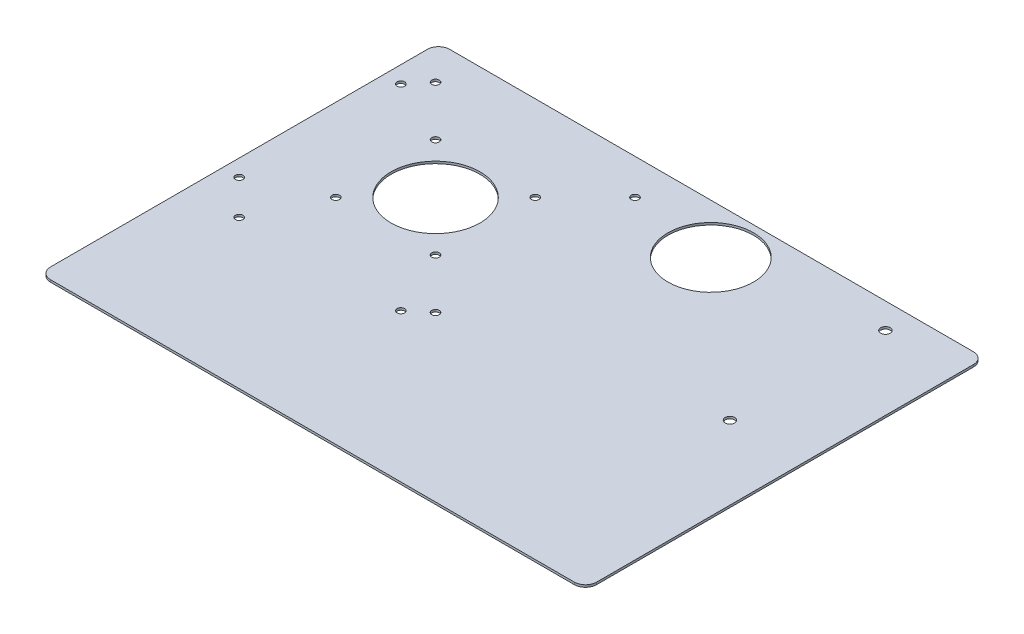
ISO-10303-21;
HEADER;
FILE_DESCRIPTION(('STEP AP214'),'2;1');
FILE_NAME('part.step','',(''),(''),'','','');
FILE_SCHEMA(('AUTOMOTIVE_DESIGN { 1 0 10303 214 1 1 1 1 }'));
ENDSEC;
DATA;
#1=APPLICATION_CONTEXT('core data for automotive mechanical design processes');
#2=APPLICATION_PROTOCOL_DEFINITION('international standard','automotive_design',2000,#1);
#3=PRODUCT_CONTEXT('',#1,'mechanical');
#4=PRODUCT('Part','Part','',(#3));
#5=PRODUCT_RELATED_PRODUCT_CATEGORY('part','',(#4));
#6=PRODUCT_DEFINITION_FORMATION('','',#4);
#7=PRODUCT_DEFINITION_CONTEXT('part definition',#1,'design');
#8=PRODUCT_DEFINITION('design','',#6,#7);
#9=PRODUCT_DEFINITION_SHAPE('','',#8);
#10=(LENGTH_UNIT() NAMED_UNIT(*) SI_UNIT(.MILLI.,.METRE.));
#11=(NAMED_UNIT(*) PLANE_ANGLE_UNIT() SI_UNIT($,.RADIAN.));
#12=(NAMED_UNIT(*) SI_UNIT($,.STERADIAN.) SOLID_ANGLE_UNIT());
#13=UNCERTAINTY_MEASURE_WITH_UNIT(LENGTH_MEASURE(1.E-05),#10,'distance_accuracy_value','');
#14=(GEOMETRIC_REPRESENTATION_CONTEXT(3) GLOBAL_UNCERTAINTY_ASSIGNED_CONTEXT((#13)) GLOBAL_UNIT_ASSIGNED_CONTEXT((#10,
#11,#12)) REPRESENTATION_CONTEXT('',''));
#15=CARTESIAN_POINT('',(0.,0.,0.));
#16=DIRECTION('',(0.,0.,1.));
#17=DIRECTION('',(1.,0.,0.));
#18=AXIS2_PLACEMENT_3D('',#15,#16,#17);
#19=CARTESIAN_POINT('',(-109.1,2.,-111.8));
#20=DIRECTION('',(0.,1.,0.));
#21=DIRECTION('',(0.,0.,1.));
#22=AXIS2_PLACEMENT_3D('',#19,#20,#21);
#23=PLANE('',#22);
#24=CARTESIAN_POINT('',(306.3,2.,41.2));
#25=DIRECTION('',(0.,1.,0.));
#26=DIRECTION('',(0.,0.,1.));
#27=AXIS2_PLACEMENT_3D('',#24,#25,#26);
#28=CIRCLE('',#27,4.30000000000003);
#29=CARTESIAN_POINT('',(306.3,2.,45.5));
#30=VERTEX_POINT('',#29);
#31=EDGE_CURVE('E276',#30,#30,#28,.T.);
#32=ORIENTED_EDGE('',*,*,#31,.F.);
#33=EDGE_LOOP('',(#32));
#34=FACE_BOUND('',#33,.T.);
#35=CARTESIAN_POINT('',(89.8,2.,-89.8));
#36=DIRECTION('',(0.,1.,0.));
#37=DIRECTION('',(0.,0.,1.));
#38=AXIS2_PLACEMENT_3D('',#35,#36,#37);
#39=CIRCLE('',#38,3.4);
#40=CARTESIAN_POINT('',(89.8,2.,-86.4));
#41=VERTEX_POINT('',#40);
#42=EDGE_CURVE('E288',#41,#41,#39,.T.);
#43=ORIENTED_EDGE('',*,*,#42,.F.);
#44=EDGE_LOOP('',(#43));
#45=FACE_BOUND('',#44,.T.);
#46=CARTESIAN_POINT('',(72.8,2.,104.));
#47=DIRECTION('',(0.,1.,0.));
#48=DIRECTION('',(0.,0.,1.));
#49=AXIS2_PLACEMENT_3D('',#46,#47,#48);
#50=CIRCLE('',#49,3.4);
#51=CARTESIAN_POINT('',(72.8,2.,107.4));
#52=VERTEX_POINT('',#51);
#53=EDGE_CURVE('E300',#52,#52,#50,.T.);
#54=ORIENTED_EDGE('',*,*,#53,.F.);
#55=EDGE_LOOP('',(#54));
#56=FACE_BOUND('',#55,.T.);
#57=CARTESIAN_POINT('',(-104.,2.,72.8));
#58=DIRECTION('',(0.,1.,0.));
#59=DIRECTION('',(0.,0.,1.));
#60=AXIS2_PLACEMENT_3D('',#57,#58,#59);
#61=CIRCLE('',#60,3.4);
#62=CARTESIAN_POINT('',(-104.,2.,76.2));
#63=VERTEX_POINT('',#62);
#64=EDGE_CURVE('E312',#63,#63,#61,.T.);
#65=ORIENTED_EDGE('',*,*,#64,.F.);
#66=EDGE_LOOP('',(#65));
#67=FACE_BOUND('',#66,.T.);
#68=CARTESIAN_POINT('',(44.9,2.,44.9));
#69=DIRECTION('',(0.,1.,0.));
#70=DIRECTION('',(0.,0.,1.));
#71=AXIS2_PLACEMENT_3D('',#68,#69,#70);
#72=CIRCLE('',#71,3.4);
#73=CARTESIAN_POINT('',(44.9,2.,48.3));
#74=VERTEX_POINT('',#73);
#75=EDGE_CURVE('E324',#74,#74,#72,.T.);
#76=ORIENTED_EDGE('',*,*,#75,.F.);
#77=EDGE_LOOP('',(#76));
#78=FACE_BOUND('',#77,.T.);
#79=CARTESIAN_POINT('',(-44.9,2.,-44.9));
#80=DIRECTION('',(0.,1.,0.));
#81=DIRECTION('',(0.,0.,1.));
#82=AXIS2_PLACEMENT_3D('',#79,#80,#81);
#83=CIRCLE('',#82,3.4);
#84=CARTESIAN_POINT('',(-44.9,2.,-41.5));
#85=VERTEX_POINT('',#84);
#86=EDGE_CURVE('E336',#85,#85,#83,.T.);
#87=ORIENTED_EDGE('',*,*,#86,.F.);
#88=EDGE_LOOP('',(#87));
#89=FACE_BOUND('',#88,.T.);
#90=CARTESIAN_POINT('',(-104.,2.,-72.8));
#91=DIRECTION('',(0.,1.,0.));
#92=DIRECTION('',(0.,0.,1.));
#93=AXIS2_PLACEMENT_3D('',#90,#91,#92);
#94=CIRCLE('',#93,3.4);
#95=CARTESIAN_POINT('',(-104.,2.,-69.4));
#96=VERTEX_POINT('',#95);
#97=EDGE_CURVE('E348',#96,#96,#94,.T.);
#98=ORIENTED_EDGE('',*,*,#97,.F.);
#99=EDGE_LOOP('',(#98));
#100=FACE_BOUND('',#99,.T.);
#101=CARTESIAN_POINT('',(-109.1,2.,-111.8));
#102=DIRECTION('',(0.,1.,0.));
#103=DIRECTION('',(0.,0.,1.));
#104=AXIS2_PLACEMENT_3D('',#101,#102,#103);
#105=CIRCLE('',#104,9.99999999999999);
#106=CARTESIAN_POINT('',(-109.1,2.,-121.8));
#107=VERTEX_POINT('',#106);
#108=CARTESIAN_POINT('',(-119.1,2.,-111.8));
#109=VERTEX_POINT('',#108);
#110=EDGE_CURVE('E132',#107,#109,#105,.T.);
#111=ORIENTED_EDGE('',*,*,#110,.T.);
#112=DIRECTION('',(0.,0.,1.));
#113=VECTOR('',#112,1.);
#114=CARTESIAN_POINT('',(-119.1,2.,-111.8));
#115=LINE('',#114,#113);
#116=CARTESIAN_POINT('',(-119.1,2.,227.5));
#117=VERTEX_POINT('',#116);
#118=EDGE_CURVE('E109',#109,#117,#115,.T.);
#119=ORIENTED_EDGE('',*,*,#118,.T.);
#120=CARTESIAN_POINT('',(-109.1,2.,227.5));
#121=DIRECTION('',(0.,1.,0.));
#122=DIRECTION('',(0.,0.,1.));
#123=AXIS2_PLACEMENT_3D('',#120,#121,#122);
#124=CIRCLE('',#123,10.);
#125=CARTESIAN_POINT('',(-109.1,2.,237.5));
#126=VERTEX_POINT('',#125);
#127=EDGE_CURVE('E135',#117,#126,#124,.T.);
#128=ORIENTED_EDGE('',*,*,#127,.T.);
#129=DIRECTION('',(1.,0.,0.));
#130=VECTOR('',#129,1.);
#131=CARTESIAN_POINT('',(-109.1,2.,237.5));
#132=LINE('',#131,#130);
#133=CARTESIAN_POINT('',(362.5,2.,237.5));
#134=VERTEX_POINT('',#133);
#135=EDGE_CURVE('E137',#126,#134,#132,.T.);
#136=ORIENTED_EDGE('',*,*,#135,.T.);
#137=CARTESIAN_POINT('',(362.5,2.,227.5));
#138=DIRECTION('',(0.,1.,0.));
#139=DIRECTION('',(0.,0.,1.));
#140=AXIS2_PLACEMENT_3D('',#137,#138,#139);
#141=CIRCLE('',#140,10.);
#142=CARTESIAN_POINT('',(372.5,2.,227.5));
#143=VERTEX_POINT('',#142);
#144=EDGE_CURVE('E139',#134,#143,#141,.T.);
#145=ORIENTED_EDGE('',*,*,#144,.T.);
#146=DIRECTION('',(0.,0.,-1.));
#147=VECTOR('',#146,1.);
#148=CARTESIAN_POINT('',(372.5,2.,227.5));
#149=LINE('',#148,#147);
#150=CARTESIAN_POINT('',(372.5,2.,-111.8));
#151=VERTEX_POINT('',#150);
#152=EDGE_CURVE('E141',#143,#151,#149,.T.);
#153=ORIENTED_EDGE('',*,*,#152,.T.);
#154=CARTESIAN_POINT('',(362.5,2.,-111.8));
#155=DIRECTION('',(0.,1.,0.));
#156=DIRECTION('',(0.,0.,1.));
#157=AXIS2_PLACEMENT_3D('',#154,#155,#156);
#158=CIRCLE('',#157,10.);
#159=CARTESIAN_POINT('',(362.5,2.,-121.8));
#160=VERTEX_POINT('',#159);
#161=EDGE_CURVE('E50',#151,#160,#158,.T.);
#162=ORIENTED_EDGE('',*,*,#161,.T.);
#163=DIRECTION('',(-1.,0.,0.));
#164=VECTOR('',#163,1.);
#165=CARTESIAN_POINT('',(362.5,2.,-121.8));
#166=LINE('',#165,#164);
#167=EDGE_CURVE('E45',#160,#107,#166,.T.);
#168=ORIENTED_EDGE('',*,*,#167,.T.);
#169=EDGE_LOOP('',(#111,#119,#128,#136,#145,#153,#162,#168));
#170=FACE_BOUND('',#169,.T.);
#171=CARTESIAN_POINT('',(0.,2.,0.));
#172=DIRECTION('',(0.,1.,0.));
#173=DIRECTION('',(0.,0.,1.));
#174=AXIS2_PLACEMENT_3D('',#171,#172,#173);
#175=CIRCLE('',#174,40.);
#176=CARTESIAN_POINT('',(0.,2.,40.));
#177=VERTEX_POINT('',#176);
#178=EDGE_CURVE('E114',#177,#177,#175,.T.);
#179=ORIENTED_EDGE('',*,*,#178,.F.);
#180=EDGE_LOOP('',(#179));
#181=FACE_BOUND('',#180,.T.);
#182=CARTESIAN_POINT('',(-89.8,2.,-89.8));
#183=DIRECTION('',(0.,1.,0.));
#184=DIRECTION('',(0.,0.,1.));
#185=AXIS2_PLACEMENT_3D('',#182,#183,#184);
#186=CIRCLE('',#185,3.39999999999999);
#187=CARTESIAN_POINT('',(-89.8,2.,-86.4));
#188=VERTEX_POINT('',#187);
#189=EDGE_CURVE('E342',#188,#188,#186,.T.);
#190=ORIENTED_EDGE('',*,*,#189,.F.);
#191=EDGE_LOOP('',(#190));
#192=FACE_BOUND('',#191,.T.);
#193=CARTESIAN_POINT('',(44.9,2.,-44.9));
#194=DIRECTION('',(0.,1.,0.));
#195=DIRECTION('',(0.,0.,1.));
#196=AXIS2_PLACEMENT_3D('',#193,#194,#195);
#197=CIRCLE('',#196,3.4);
#198=CARTESIAN_POINT('',(44.9,2.,-41.5));
#199=VERTEX_POINT('',#198);
#200=EDGE_CURVE('E330',#199,#199,#197,.T.);
#201=ORIENTED_EDGE('',*,*,#200,.F.);
#202=EDGE_LOOP('',(#201));
#203=FACE_BOUND('',#202,.T.);
#204=CARTESIAN_POINT('',(-44.9,2.,44.9));
#205=DIRECTION('',(0.,1.,0.));
#206=DIRECTION('',(0.,0.,1.));
#207=AXIS2_PLACEMENT_3D('',#204,#205,#206);
#208=CIRCLE('',#207,3.4);
#209=CARTESIAN_POINT('',(-44.9,2.,48.3));
#210=VERTEX_POINT('',#209);
#211=EDGE_CURVE('E318',#210,#210,#208,.T.);
#212=ORIENTED_EDGE('',*,*,#211,.F.);
#213=EDGE_LOOP('',(#212));
#214=FACE_BOUND('',#213,.T.);
#215=CARTESIAN_POINT('',(-72.8,2.,104.));
#216=DIRECTION('',(0.,1.,0.));
#217=DIRECTION('',(0.,0.,1.));
#218=AXIS2_PLACEMENT_3D('',#215,#216,#217);
#219=CIRCLE('',#218,3.4);
#220=CARTESIAN_POINT('',(-72.8,2.,107.4));
#221=VERTEX_POINT('',#220);
#222=EDGE_CURVE('E306',#221,#221,#219,.T.);
#223=ORIENTED_EDGE('',*,*,#222,.F.);
#224=EDGE_LOOP('',(#223));
#225=FACE_BOUND('',#224,.T.);
#226=CARTESIAN_POINT('',(89.8,2.,89.8));
#227=DIRECTION('',(0.,1.,0.));
#228=DIRECTION('',(0.,0.,1.));
#229=AXIS2_PLACEMENT_3D('',#226,#227,#228);
#230=CIRCLE('',#229,3.4);
#231=CARTESIAN_POINT('',(89.8,2.,93.2));
#232=VERTEX_POINT('',#231);
#233=EDGE_CURVE('E294',#232,#232,#230,.T.);
#234=ORIENTED_EDGE('',*,*,#233,.F.);
#235=EDGE_LOOP('',(#234));
#236=FACE_BOUND('',#235,.T.);
#237=CARTESIAN_POINT('',(306.3,2.,-98.8));
#238=DIRECTION('',(0.,1.,0.));
#239=DIRECTION('',(0.,0.,1.));
#240=AXIS2_PLACEMENT_3D('',#237,#238,#239);
#241=CIRCLE('',#240,4.30000000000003);
#242=CARTESIAN_POINT('',(306.3,2.,-94.5));
#243=VERTEX_POINT('',#242);
#244=EDGE_CURVE('E282',#243,#243,#241,.T.);
#245=ORIENTED_EDGE('',*,*,#244,.F.);
#246=EDGE_LOOP('',(#245));
#247=FACE_BOUND('',#246,.T.);
#248=CARTESIAN_POINT('',(170.7,2.,-77.1));
#249=DIRECTION('',(0.,1.,0.));
#250=DIRECTION('',(0.,0.,1.));
#251=AXIS2_PLACEMENT_3D('',#248,#249,#250);
#252=CIRCLE('',#251,38.5);
#253=CARTESIAN_POINT('',(170.7,2.,-38.6));
#254=VERTEX_POINT('',#253);
#255=EDGE_CURVE('E265',#254,#254,#252,.T.);
#256=ORIENTED_EDGE('',*,*,#255,.F.);
#257=EDGE_LOOP('',(#256));
#258=FACE_BOUND('',#257,.T.);
#259=ADVANCED_FACE('F30',(#34,#45,#56,#67,#78,#89,#100,#170,#181,#192,#203,#214,#225,#236,#247,
#258),#23,.T.);
#260=CARTESIAN_POINT('',(-109.1,0.,-111.8));
#261=DIRECTION('',(0.,1.,0.));
#262=DIRECTION('',(0.,0.,1.));
#263=AXIS2_PLACEMENT_3D('',#260,#261,#262);
#264=PLANE('',#263);
#265=CARTESIAN_POINT('',(306.3,0.,41.2));
#266=DIRECTION('',(0.,1.,0.));
#267=DIRECTION('',(0.,0.,1.));
#268=AXIS2_PLACEMENT_3D('',#265,#266,#267);
#269=CIRCLE('',#268,4.30000000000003);
#270=CARTESIAN_POINT('',(306.3,0.,45.5));
#271=VERTEX_POINT('',#270);
#272=EDGE_CURVE('E271',#271,#271,#269,.T.);
#273=ORIENTED_EDGE('',*,*,#272,.T.);
#274=EDGE_LOOP('',(#273));
#275=FACE_BOUND('',#274,.T.);
#276=CARTESIAN_POINT('',(89.8,0.,-89.8));
#277=DIRECTION('',(0.,1.,0.));
#278=DIRECTION('',(0.,0.,1.));
#279=AXIS2_PLACEMENT_3D('',#276,#277,#278);
#280=CIRCLE('',#279,3.4);
#281=CARTESIAN_POINT('',(89.8,0.,-86.4));
#282=VERTEX_POINT('',#281);
#283=EDGE_CURVE('E285',#282,#282,#280,.T.);
#284=ORIENTED_EDGE('',*,*,#283,.T.);
#285=EDGE_LOOP('',(#284));
#286=FACE_BOUND('',#285,.T.);
#287=CARTESIAN_POINT('',(72.8,0.,104.));
#288=DIRECTION('',(0.,1.,0.));
#289=DIRECTION('',(0.,0.,1.));
#290=AXIS2_PLACEMENT_3D('',#287,#288,#289);
#291=CIRCLE('',#290,3.4);
#292=CARTESIAN_POINT('',(72.8,0.,107.4));
#293=VERTEX_POINT('',#292);
#294=EDGE_CURVE('E297',#293,#293,#291,.T.);
#295=ORIENTED_EDGE('',*,*,#294,.T.);
#296=EDGE_LOOP('',(#295));
#297=FACE_BOUND('',#296,.T.);
#298=CARTESIAN_POINT('',(-104.,0.,72.8));
#299=DIRECTION('',(0.,1.,0.));
#300=DIRECTION('',(0.,0.,1.));
#301=AXIS2_PLACEMENT_3D('',#298,#299,#300);
#302=CIRCLE('',#301,3.4);
#303=CARTESIAN_POINT('',(-104.,0.,76.2));
#304=VERTEX_POINT('',#303);
#305=EDGE_CURVE('E309',#304,#304,#302,.T.);
#306=ORIENTED_EDGE('',*,*,#305,.T.);
#307=EDGE_LOOP('',(#306));
#308=FACE_BOUND('',#307,.T.);
#309=CARTESIAN_POINT('',(44.9,0.,44.9));
#310=DIRECTION('',(0.,1.,0.));
#311=DIRECTION('',(0.,0.,1.));
#312=AXIS2_PLACEMENT_3D('',#309,#310,#311);
#313=CIRCLE('',#312,3.4);
#314=CARTESIAN_POINT('',(44.9,0.,48.3));
#315=VERTEX_POINT('',#314);
#316=EDGE_CURVE('E321',#315,#315,#313,.T.);
#317=ORIENTED_EDGE('',*,*,#316,.T.);
#318=EDGE_LOOP('',(#317));
#319=FACE_BOUND('',#318,.T.);
#320=CARTESIAN_POINT('',(-44.9,0.,-44.9));
#321=DIRECTION('',(0.,1.,0.));
#322=DIRECTION('',(0.,0.,1.));
#323=AXIS2_PLACEMENT_3D('',#320,#321,#322);
#324=CIRCLE('',#323,3.4);
#325=CARTESIAN_POINT('',(-44.9,0.,-41.5));
#326=VERTEX_POINT('',#325);
#327=EDGE_CURVE('E333',#326,#326,#324,.T.);
#328=ORIENTED_EDGE('',*,*,#327,.T.);
#329=EDGE_LOOP('',(#328));
#330=FACE_BOUND('',#329,.T.);
#331=CARTESIAN_POINT('',(-104.,0.,-72.8));
#332=DIRECTION('',(0.,1.,0.));
#333=DIRECTION('',(0.,0.,1.));
#334=AXIS2_PLACEMENT_3D('',#331,#332,#333);
#335=CIRCLE('',#334,3.4);
#336=CARTESIAN_POINT('',(-104.,0.,-69.4));
#337=VERTEX_POINT('',#336);
#338=EDGE_CURVE('E345',#337,#337,#335,.T.);
#339=ORIENTED_EDGE('',*,*,#338,.T.);
#340=EDGE_LOOP('',(#339));
#341=FACE_BOUND('',#340,.T.);
#342=CARTESIAN_POINT('',(-109.1,0.,-111.8));
#343=DIRECTION('',(0.,1.,0.));
#344=DIRECTION('',(0.,0.,1.));
#345=AXIS2_PLACEMENT_3D('',#342,#343,#344);
#346=CIRCLE('',#345,9.99999999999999);
#347=CARTESIAN_POINT('',(-109.1,0.,-121.8));
#348=VERTEX_POINT('',#347);
#349=CARTESIAN_POINT('',(-119.1,0.,-111.8));
#350=VERTEX_POINT('',#349);
#351=EDGE_CURVE('E100',#348,#350,#346,.T.);
#352=ORIENTED_EDGE('',*,*,#351,.F.);
#353=DIRECTION('',(-1.,0.,0.));
#354=VECTOR('',#353,1.);
#355=CARTESIAN_POINT('',(362.5,0.,-121.8));
#356=LINE('',#355,#354);
#357=CARTESIAN_POINT('',(362.5,0.,-121.8));
#358=VERTEX_POINT('',#357);
#359=EDGE_CURVE('E130',#358,#348,#356,.T.);
#360=ORIENTED_EDGE('',*,*,#359,.F.);
#361=CARTESIAN_POINT('',(362.5,0.,-111.8));
#362=DIRECTION('',(0.,1.,0.));
#363=DIRECTION('',(0.,0.,1.));
#364=AXIS2_PLACEMENT_3D('',#361,#362,#363);
#365=CIRCLE('',#364,10.);
#366=CARTESIAN_POINT('',(372.5,0.,-111.8));
#367=VERTEX_POINT('',#366);
#368=EDGE_CURVE('E128',#367,#358,#365,.T.);
#369=ORIENTED_EDGE('',*,*,#368,.F.);
#370=DIRECTION('',(0.,0.,-1.));
#371=VECTOR('',#370,1.);
#372=CARTESIAN_POINT('',(372.5,0.,227.5));
#373=LINE('',#372,#371);
#374=CARTESIAN_POINT('',(372.5,0.,227.5));
#375=VERTEX_POINT('',#374);
#376=EDGE_CURVE('E126',#375,#367,#373,.T.);
#377=ORIENTED_EDGE('',*,*,#376,.F.);
#378=CARTESIAN_POINT('',(362.5,0.,227.5));
#379=DIRECTION('',(0.,1.,0.));
#380=DIRECTION('',(0.,0.,1.));
#381=AXIS2_PLACEMENT_3D('',#378,#379,#380);
#382=CIRCLE('',#381,10.);
#383=CARTESIAN_POINT('',(362.5,0.,237.5));
#384=VERTEX_POINT('',#383);
#385=EDGE_CURVE('E124',#384,#375,#382,.T.);
#386=ORIENTED_EDGE('',*,*,#385,.F.);
#387=DIRECTION('',(1.,0.,0.));
#388=VECTOR('',#387,1.);
#389=CARTESIAN_POINT('',(-109.1,0.,237.5));
#390=LINE('',#389,#388);
#391=CARTESIAN_POINT('',(-109.1,0.,237.5));
#392=VERTEX_POINT('',#391);
#393=EDGE_CURVE('E122',#392,#384,#390,.T.);
#394=ORIENTED_EDGE('',*,*,#393,.F.);
#395=CARTESIAN_POINT('',(-109.1,0.,227.5));
#396=DIRECTION('',(0.,1.,0.));
#397=DIRECTION('',(0.,0.,1.));
#398=AXIS2_PLACEMENT_3D('',#395,#396,#397);
#399=CIRCLE('',#398,10.);
#400=CARTESIAN_POINT('',(-119.1,0.,227.5));
#401=VERTEX_POINT('',#400);
#402=EDGE_CURVE('E102',#401,#392,#399,.T.);
#403=ORIENTED_EDGE('',*,*,#402,.F.);
#404=DIRECTION('',(0.,0.,1.));
#405=VECTOR('',#404,1.);
#406=CARTESIAN_POINT('',(-119.1,0.,-111.8));
#407=LINE('',#406,#405);
#408=EDGE_CURVE('E95',#350,#401,#407,.T.);
#409=ORIENTED_EDGE('',*,*,#408,.F.);
#410=EDGE_LOOP('',(#352,#360,#369,#377,#386,#394,#403,#409));
#411=FACE_BOUND('',#410,.T.);
#412=CARTESIAN_POINT('',(0.,0.,0.));
#413=DIRECTION('',(0.,1.,0.));
#414=DIRECTION('',(0.,0.,1.));
#415=AXIS2_PLACEMENT_3D('',#412,#413,#414);
#416=CIRCLE('',#415,40.);
#417=CARTESIAN_POINT('',(0.,0.,40.));
#418=VERTEX_POINT('',#417);
#419=EDGE_CURVE('E117',#418,#418,#416,.T.);
#420=ORIENTED_EDGE('',*,*,#419,.T.);
#421=EDGE_LOOP('',(#420));
#422=FACE_BOUND('',#421,.T.);
#423=CARTESIAN_POINT('',(-89.8,0.,-89.8));
#424=DIRECTION('',(0.,1.,0.));
#425=DIRECTION('',(0.,0.,1.));
#426=AXIS2_PLACEMENT_3D('',#423,#424,#425);
#427=CIRCLE('',#426,3.39999999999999);
#428=CARTESIAN_POINT('',(-89.8,0.,-86.4));
#429=VERTEX_POINT('',#428);
#430=EDGE_CURVE('E339',#429,#429,#427,.T.);
#431=ORIENTED_EDGE('',*,*,#430,.T.);
#432=EDGE_LOOP('',(#431));
#433=FACE_BOUND('',#432,.T.);
#434=CARTESIAN_POINT('',(44.9,0.,-44.9));
#435=DIRECTION('',(0.,1.,0.));
#436=DIRECTION('',(0.,0.,1.));
#437=AXIS2_PLACEMENT_3D('',#434,#435,#436);
#438=CIRCLE('',#437,3.4);
#439=CARTESIAN_POINT('',(44.9,0.,-41.5));
#440=VERTEX_POINT('',#439);
#441=EDGE_CURVE('E327',#440,#440,#438,.T.);
#442=ORIENTED_EDGE('',*,*,#441,.T.);
#443=EDGE_LOOP('',(#442));
#444=FACE_BOUND('',#443,.T.);
#445=CARTESIAN_POINT('',(-44.9,0.,44.9));
#446=DIRECTION('',(0.,1.,0.));
#447=DIRECTION('',(0.,0.,1.));
#448=AXIS2_PLACEMENT_3D('',#445,#446,#447);
#449=CIRCLE('',#448,3.4);
#450=CARTESIAN_POINT('',(-44.9,0.,48.3));
#451=VERTEX_POINT('',#450);
#452=EDGE_CURVE('E315',#451,#451,#449,.T.);
#453=ORIENTED_EDGE('',*,*,#452,.T.);
#454=EDGE_LOOP('',(#453));
#455=FACE_BOUND('',#454,.T.);
#456=CARTESIAN_POINT('',(-72.8,0.,104.));
#457=DIRECTION('',(0.,1.,0.));
#458=DIRECTION('',(0.,0.,1.));
#459=AXIS2_PLACEMENT_3D('',#456,#457,#458);
#460=CIRCLE('',#459,3.4);
#461=CARTESIAN_POINT('',(-72.8,0.,107.4));
#462=VERTEX_POINT('',#461);
#463=EDGE_CURVE('E303',#462,#462,#460,.T.);
#464=ORIENTED_EDGE('',*,*,#463,.T.);
#465=EDGE_LOOP('',(#464));
#466=FACE_BOUND('',#465,.T.);
#467=CARTESIAN_POINT('',(89.8,0.,89.8));
#468=DIRECTION('',(0.,1.,0.));
#469=DIRECTION('',(0.,0.,1.));
#470=AXIS2_PLACEMENT_3D('',#467,#468,#469);
#471=CIRCLE('',#470,3.4);
#472=CARTESIAN_POINT('',(89.8,0.,93.2));
#473=VERTEX_POINT('',#472);
#474=EDGE_CURVE('E291',#473,#473,#471,.T.);
#475=ORIENTED_EDGE('',*,*,#474,.T.);
#476=EDGE_LOOP('',(#475));
#477=FACE_BOUND('',#476,.T.);
#478=CARTESIAN_POINT('',(306.3,0.,-98.8));
#479=DIRECTION('',(0.,1.,0.));
#480=DIRECTION('',(0.,0.,1.));
#481=AXIS2_PLACEMENT_3D('',#478,#479,#480);
#482=CIRCLE('',#481,4.30000000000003);
#483=CARTESIAN_POINT('',(306.3,0.,-94.5));
#484=VERTEX_POINT('',#483);
#485=EDGE_CURVE('E279',#484,#484,#482,.T.);
#486=ORIENTED_EDGE('',*,*,#485,.T.);
#487=EDGE_LOOP('',(#486));
#488=FACE_BOUND('',#487,.T.);
#489=CARTESIAN_POINT('',(170.7,0.,-77.1));
#490=DIRECTION('',(0.,1.,0.));
#491=DIRECTION('',(0.,0.,1.));
#492=AXIS2_PLACEMENT_3D('',#489,#490,#491);
#493=CIRCLE('',#492,38.5);
#494=CARTESIAN_POINT('',(170.7,0.,-38.6));
#495=VERTEX_POINT('',#494);
#496=EDGE_CURVE('E268',#495,#495,#493,.T.);
#497=ORIENTED_EDGE('',*,*,#496,.T.);
#498=EDGE_LOOP('',(#497));
#499=FACE_BOUND('',#498,.T.);
#500=ADVANCED_FACE('F96',(#275,#286,#297,#308,#319,#330,#341,#411,#422,#433,#444,#455,#466,#477,
#488,#499),#264,.F.);
#501=CARTESIAN_POINT('',(-109.1,2.,-111.8));
#502=DIRECTION('',(0.,-1.,0.));
#503=DIRECTION('',(0.,0.,-1.));
#504=AXIS2_PLACEMENT_3D('',#501,#502,#503);
#505=CYLINDRICAL_SURFACE('',#504,9.99999999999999);
#506=ORIENTED_EDGE('',*,*,#351,.T.);
#507=DIRECTION('',(0.,-1.,0.));
#508=VECTOR('',#507,1.);
#509=CARTESIAN_POINT('',(-119.1,2.,-111.8));
#510=LINE('',#509,#508);
#511=EDGE_CURVE('E11',#109,#350,#510,.T.);
#512=ORIENTED_EDGE('',*,*,#511,.F.);
#513=ORIENTED_EDGE('',*,*,#110,.F.);
#514=DIRECTION('',(0.,-1.,0.));
#515=VECTOR('',#514,1.);
#516=CARTESIAN_POINT('',(-109.1,2.,-121.8));
#517=LINE('',#516,#515);
#518=EDGE_CURVE('E113',#107,#348,#517,.T.);
#519=ORIENTED_EDGE('',*,*,#518,.T.);
#520=EDGE_LOOP('',(#506,#512,#513,#519));
#521=FACE_BOUND('',#520,.T.);
#522=ADVANCED_FACE('F32',(#521),#505,.T.);
#523=CARTESIAN_POINT('',(-119.1,2.,-111.8));
#524=DIRECTION('',(1.,0.,0.));
#525=DIRECTION('',(0.,0.,-1.));
#526=AXIS2_PLACEMENT_3D('',#523,#524,#525);
#527=PLANE('',#526);
#528=ORIENTED_EDGE('',*,*,#408,.T.);
#529=DIRECTION('',(0.,-1.,0.));
#530=VECTOR('',#529,1.);
#531=CARTESIAN_POINT('',(-119.1,2.,227.5));
#532=LINE('',#531,#530);
#533=EDGE_CURVE('E38',#117,#401,#532,.T.);
#534=ORIENTED_EDGE('',*,*,#533,.F.);
#535=ORIENTED_EDGE('',*,*,#118,.F.);
#536=ORIENTED_EDGE('',*,*,#511,.T.);
#537=EDGE_LOOP('',(#528,#534,#535,#536));
#538=FACE_BOUND('',#537,.T.);
#539=ADVANCED_FACE('F108',(#538),#527,.F.);
#540=CARTESIAN_POINT('',(-109.1,2.,227.5));
#541=DIRECTION('',(0.,-1.,0.));
#542=DIRECTION('',(0.,0.,-1.));
#543=AXIS2_PLACEMENT_3D('',#540,#541,#542);
#544=CYLINDRICAL_SURFACE('',#543,10.);
#545=ORIENTED_EDGE('',*,*,#402,.T.);
#546=DIRECTION('',(0.,-1.,0.));
#547=VECTOR('',#546,1.);
#548=CARTESIAN_POINT('',(-109.1,2.,237.5));
#549=LINE('',#548,#547);
#550=EDGE_CURVE('E158',#126,#392,#549,.T.);
#551=ORIENTED_EDGE('',*,*,#550,.F.);
#552=ORIENTED_EDGE('',*,*,#127,.F.);
#553=ORIENTED_EDGE('',*,*,#533,.T.);
#554=EDGE_LOOP('',(#545,#551,#552,#553));
#555=FACE_BOUND('',#554,.T.);
#556=ADVANCED_FACE('F162',(#555),#544,.T.);
#557=CARTESIAN_POINT('',(-109.1,2.,237.5));
#558=DIRECTION('',(0.,0.,-1.));
#559=DIRECTION('',(-1.,0.,0.));
#560=AXIS2_PLACEMENT_3D('',#557,#558,#559);
#561=PLANE('',#560);
#562=ORIENTED_EDGE('',*,*,#393,.T.);
#563=DIRECTION('',(0.,-1.,0.));
#564=VECTOR('',#563,1.);
#565=CARTESIAN_POINT('',(362.5,2.,237.5));
#566=LINE('',#565,#564);
#567=EDGE_CURVE('E155',#134,#384,#566,.T.);
#568=ORIENTED_EDGE('',*,*,#567,.F.);
#569=ORIENTED_EDGE('',*,*,#135,.F.);
#570=ORIENTED_EDGE('',*,*,#550,.T.);
#571=EDGE_LOOP('',(#562,#568,#569,#570));
#572=FACE_BOUND('',#571,.T.);
#573=ADVANCED_FACE('F170',(#572),#561,.F.);
#574=CARTESIAN_POINT('',(362.5,2.,227.5));
#575=DIRECTION('',(0.,-1.,0.));
#576=DIRECTION('',(0.,0.,-1.));
#577=AXIS2_PLACEMENT_3D('',#574,#575,#576);
#578=CYLINDRICAL_SURFACE('',#577,10.);
#579=ORIENTED_EDGE('',*,*,#385,.T.);
#580=DIRECTION('',(0.,-1.,0.));
#581=VECTOR('',#580,1.);
#582=CARTESIAN_POINT('',(372.5,2.,227.5));
#583=LINE('',#582,#581);
#584=EDGE_CURVE('E152',#143,#375,#583,.T.);
#585=ORIENTED_EDGE('',*,*,#584,.F.);
#586=ORIENTED_EDGE('',*,*,#144,.F.);
#587=ORIENTED_EDGE('',*,*,#567,.T.);
#588=EDGE_LOOP('',(#579,#585,#586,#587));
#589=FACE_BOUND('',#588,.T.);
#590=ADVANCED_FACE('F173',(#589),#578,.T.);
#591=CARTESIAN_POINT('',(372.5,2.,227.5));
#592=DIRECTION('',(-1.,0.,0.));
#593=DIRECTION('',(0.,0.,1.));
#594=AXIS2_PLACEMENT_3D('',#591,#592,#593);
#595=PLANE('',#594);
#596=ORIENTED_EDGE('',*,*,#376,.T.);
#597=DIRECTION('',(0.,-1.,0.));
#598=VECTOR('',#597,1.);
#599=CARTESIAN_POINT('',(372.5,2.,-111.8));
#600=LINE('',#599,#598);
#601=EDGE_CURVE('E149',#151,#367,#600,.T.);
#602=ORIENTED_EDGE('',*,*,#601,.F.);
#603=ORIENTED_EDGE('',*,*,#152,.F.);
#604=ORIENTED_EDGE('',*,*,#584,.T.);
#605=EDGE_LOOP('',(#596,#602,#603,#604));
#606=FACE_BOUND('',#605,.T.);
#607=ADVANCED_FACE('F178',(#606),#595,.F.);
#608=CARTESIAN_POINT('',(362.5,2.,-111.8));
#609=DIRECTION('',(0.,-1.,0.));
#610=DIRECTION('',(0.,0.,-1.));
#611=AXIS2_PLACEMENT_3D('',#608,#609,#610);
#612=CYLINDRICAL_SURFACE('',#611,10.);
#613=ORIENTED_EDGE('',*,*,#368,.T.);
#614=DIRECTION('',(0.,-1.,0.));
#615=VECTOR('',#614,1.);
#616=CARTESIAN_POINT('',(362.5,2.,-121.8));
#617=LINE('',#616,#615);
#618=EDGE_CURVE('E146',#160,#358,#617,.T.);
#619=ORIENTED_EDGE('',*,*,#618,.F.);
#620=ORIENTED_EDGE('',*,*,#161,.F.);
#621=ORIENTED_EDGE('',*,*,#601,.T.);
#622=EDGE_LOOP('',(#613,#619,#620,#621));
#623=FACE_BOUND('',#622,.T.);
#624=ADVANCED_FACE('F181',(#623),#612,.T.);
#625=CARTESIAN_POINT('',(362.5,2.,-121.8));
#626=DIRECTION('',(0.,0.,1.));
#627=DIRECTION('',(1.,0.,0.));
#628=AXIS2_PLACEMENT_3D('',#625,#626,#627);
#629=PLANE('',#628);
#630=ORIENTED_EDGE('',*,*,#359,.T.);
#631=ORIENTED_EDGE('',*,*,#518,.F.);
#632=ORIENTED_EDGE('',*,*,#167,.F.);
#633=ORIENTED_EDGE('',*,*,#618,.T.);
#634=EDGE_LOOP('',(#630,#631,#632,#633));
#635=FACE_BOUND('',#634,.T.);
#636=ADVANCED_FACE('F183',(#635),#629,.F.);
#637=CARTESIAN_POINT('',(0.,2.,0.));
#638=DIRECTION('',(0.,-1.,0.));
#639=DIRECTION('',(0.,0.,-1.));
#640=AXIS2_PLACEMENT_3D('',#637,#638,#639);
#641=CYLINDRICAL_SURFACE('',#640,40.);
#642=ORIENTED_EDGE('',*,*,#178,.T.);
#643=EDGE_LOOP('',(#642));
#644=FACE_BOUND('',#643,.T.);
#645=ORIENTED_EDGE('',*,*,#419,.F.);
#646=EDGE_LOOP('',(#645));
#647=FACE_BOUND('',#646,.T.);
#648=ADVANCED_FACE('F185',(#644,#647),#641,.F.);
#649=CARTESIAN_POINT('',(-104.,2.,-72.8));
#650=DIRECTION('',(0.,-1.,0.));
#651=DIRECTION('',(0.,0.,-1.));
#652=AXIS2_PLACEMENT_3D('',#649,#650,#651);
#653=CYLINDRICAL_SURFACE('',#652,3.4);
#654=ORIENTED_EDGE('',*,*,#97,.T.);
#655=EDGE_LOOP('',(#654));
#656=FACE_BOUND('',#655,.T.);
#657=ORIENTED_EDGE('',*,*,#338,.F.);
#658=EDGE_LOOP('',(#657));
#659=FACE_BOUND('',#658,.T.);
#660=ADVANCED_FACE('F191',(#656,#659),#653,.F.);
#661=CARTESIAN_POINT('',(-89.8,2.,-89.8));
#662=DIRECTION('',(0.,-1.,0.));
#663=DIRECTION('',(0.,0.,-1.));
#664=AXIS2_PLACEMENT_3D('',#661,#662,#663);
#665=CYLINDRICAL_SURFACE('',#664,3.39999999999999);
#666=ORIENTED_EDGE('',*,*,#189,.T.);
#667=EDGE_LOOP('',(#666));
#668=FACE_BOUND('',#667,.T.);
#669=ORIENTED_EDGE('',*,*,#430,.F.);
#670=EDGE_LOOP('',(#669));
#671=FACE_BOUND('',#670,.T.);
#672=ADVANCED_FACE('F208',(#668,#671),#665,.F.);
#673=CARTESIAN_POINT('',(-44.9,2.,-44.9));
#674=DIRECTION('',(0.,-1.,0.));
#675=DIRECTION('',(0.,0.,-1.));
#676=AXIS2_PLACEMENT_3D('',#673,#674,#675);
#677=CYLINDRICAL_SURFACE('',#676,3.4);
#678=ORIENTED_EDGE('',*,*,#86,.T.);
#679=EDGE_LOOP('',(#678));
#680=FACE_BOUND('',#679,.T.);
#681=ORIENTED_EDGE('',*,*,#327,.F.);
#682=EDGE_LOOP('',(#681));
#683=FACE_BOUND('',#682,.T.);
#684=ADVANCED_FACE('F212',(#680,#683),#677,.F.);
#685=CARTESIAN_POINT('',(44.9,2.,-44.9));
#686=DIRECTION('',(0.,-1.,0.));
#687=DIRECTION('',(0.,0.,-1.));
#688=AXIS2_PLACEMENT_3D('',#685,#686,#687);
#689=CYLINDRICAL_SURFACE('',#688,3.4);
#690=ORIENTED_EDGE('',*,*,#200,.T.);
#691=EDGE_LOOP('',(#690));
#692=FACE_BOUND('',#691,.T.);
#693=ORIENTED_EDGE('',*,*,#441,.F.);
#694=EDGE_LOOP('',(#693));
#695=FACE_BOUND('',#694,.T.);
#696=ADVANCED_FACE('F216',(#692,#695),#689,.F.);
#697=CARTESIAN_POINT('',(44.9,2.,44.9));
#698=DIRECTION('',(0.,-1.,0.));
#699=DIRECTION('',(0.,0.,-1.));
#700=AXIS2_PLACEMENT_3D('',#697,#698,#699);
#701=CYLINDRICAL_SURFACE('',#700,3.4);
#702=ORIENTED_EDGE('',*,*,#75,.T.);
#703=EDGE_LOOP('',(#702));
#704=FACE_BOUND('',#703,.T.);
#705=ORIENTED_EDGE('',*,*,#316,.F.);
#706=EDGE_LOOP('',(#705));
#707=FACE_BOUND('',#706,.T.);
#708=ADVANCED_FACE('F220',(#704,#707),#701,.F.);
#709=CARTESIAN_POINT('',(-44.9,2.,44.9));
#710=DIRECTION('',(0.,-1.,0.));
#711=DIRECTION('',(0.,0.,-1.));
#712=AXIS2_PLACEMENT_3D('',#709,#710,#711);
#713=CYLINDRICAL_SURFACE('',#712,3.4);
#714=ORIENTED_EDGE('',*,*,#211,.T.);
#715=EDGE_LOOP('',(#714));
#716=FACE_BOUND('',#715,.T.);
#717=ORIENTED_EDGE('',*,*,#452,.F.);
#718=EDGE_LOOP('',(#717));
#719=FACE_BOUND('',#718,.T.);
#720=ADVANCED_FACE('F224',(#716,#719),#713,.F.);
#721=CARTESIAN_POINT('',(-104.,2.,72.8));
#722=DIRECTION('',(0.,-1.,0.));
#723=DIRECTION('',(0.,0.,-1.));
#724=AXIS2_PLACEMENT_3D('',#721,#722,#723);
#725=CYLINDRICAL_SURFACE('',#724,3.4);
#726=ORIENTED_EDGE('',*,*,#64,.T.);
#727=EDGE_LOOP('',(#726));
#728=FACE_BOUND('',#727,.T.);
#729=ORIENTED_EDGE('',*,*,#305,.F.);
#730=EDGE_LOOP('',(#729));
#731=FACE_BOUND('',#730,.T.);
#732=ADVANCED_FACE('F228',(#728,#731),#725,.F.);
#733=CARTESIAN_POINT('',(-72.8,2.,104.));
#734=DIRECTION('',(0.,-1.,0.));
#735=DIRECTION('',(0.,0.,-1.));
#736=AXIS2_PLACEMENT_3D('',#733,#734,#735);
#737=CYLINDRICAL_SURFACE('',#736,3.4);
#738=ORIENTED_EDGE('',*,*,#222,.T.);
#739=EDGE_LOOP('',(#738));
#740=FACE_BOUND('',#739,.T.);
#741=ORIENTED_EDGE('',*,*,#463,.F.);
#742=EDGE_LOOP('',(#741));
#743=FACE_BOUND('',#742,.T.);
#744=ADVANCED_FACE('F232',(#740,#743),#737,.F.);
#745=CARTESIAN_POINT('',(72.8,2.,104.));
#746=DIRECTION('',(0.,-1.,0.));
#747=DIRECTION('',(0.,0.,-1.));
#748=AXIS2_PLACEMENT_3D('',#745,#746,#747);
#749=CYLINDRICAL_SURFACE('',#748,3.4);
#750=ORIENTED_EDGE('',*,*,#53,.T.);
#751=EDGE_LOOP('',(#750));
#752=FACE_BOUND('',#751,.T.);
#753=ORIENTED_EDGE('',*,*,#294,.F.);
#754=EDGE_LOOP('',(#753));
#755=FACE_BOUND('',#754,.T.);
#756=ADVANCED_FACE('F236',(#752,#755),#749,.F.);
#757=CARTESIAN_POINT('',(89.8,2.,89.8));
#758=DIRECTION('',(0.,-1.,0.));
#759=DIRECTION('',(0.,0.,-1.));
#760=AXIS2_PLACEMENT_3D('',#757,#758,#759);
#761=CYLINDRICAL_SURFACE('',#760,3.4);
#762=ORIENTED_EDGE('',*,*,#233,.T.);
#763=EDGE_LOOP('',(#762));
#764=FACE_BOUND('',#763,.T.);
#765=ORIENTED_EDGE('',*,*,#474,.F.);
#766=EDGE_LOOP('',(#765));
#767=FACE_BOUND('',#766,.T.);
#768=ADVANCED_FACE('F240',(#764,#767),#761,.F.);
#769=CARTESIAN_POINT('',(89.8,2.,-89.8));
#770=DIRECTION('',(0.,-1.,0.));
#771=DIRECTION('',(0.,0.,-1.));
#772=AXIS2_PLACEMENT_3D('',#769,#770,#771);
#773=CYLINDRICAL_SURFACE('',#772,3.4);
#774=ORIENTED_EDGE('',*,*,#42,.T.);
#775=EDGE_LOOP('',(#774));
#776=FACE_BOUND('',#775,.T.);
#777=ORIENTED_EDGE('',*,*,#283,.F.);
#778=EDGE_LOOP('',(#777));
#779=FACE_BOUND('',#778,.T.);
#780=ADVANCED_FACE('F244',(#776,#779),#773,.F.);
#781=CARTESIAN_POINT('',(306.3,2.,-98.8));
#782=DIRECTION('',(0.,-1.,0.));
#783=DIRECTION('',(0.,0.,-1.));
#784=AXIS2_PLACEMENT_3D('',#781,#782,#783);
#785=CYLINDRICAL_SURFACE('',#784,4.30000000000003);
#786=ORIENTED_EDGE('',*,*,#244,.T.);
#787=EDGE_LOOP('',(#786));
#788=FACE_BOUND('',#787,.T.);
#789=ORIENTED_EDGE('',*,*,#485,.F.);
#790=EDGE_LOOP('',(#789));
#791=FACE_BOUND('',#790,.T.);
#792=ADVANCED_FACE('F248',(#788,#791),#785,.F.);
#793=CARTESIAN_POINT('',(306.3,2.,41.2));
#794=DIRECTION('',(0.,-1.,0.));
#795=DIRECTION('',(0.,0.,-1.));
#796=AXIS2_PLACEMENT_3D('',#793,#794,#795);
#797=CYLINDRICAL_SURFACE('',#796,4.30000000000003);
#798=ORIENTED_EDGE('',*,*,#31,.T.);
#799=EDGE_LOOP('',(#798));
#800=FACE_BOUND('',#799,.T.);
#801=ORIENTED_EDGE('',*,*,#272,.F.);
#802=EDGE_LOOP('',(#801));
#803=FACE_BOUND('',#802,.T.);
#804=ADVANCED_FACE('F252',(#800,#803),#797,.F.);
#805=CARTESIAN_POINT('',(170.7,2.,-77.1));
#806=DIRECTION('',(0.,-1.,0.));
#807=DIRECTION('',(0.,0.,-1.));
#808=AXIS2_PLACEMENT_3D('',#805,#806,#807);
#809=CYLINDRICAL_SURFACE('',#808,38.5);
#810=ORIENTED_EDGE('',*,*,#255,.T.);
#811=EDGE_LOOP('',(#810));
#812=FACE_BOUND('',#811,.T.);
#813=ORIENTED_EDGE('',*,*,#496,.F.);
#814=EDGE_LOOP('',(#813));
#815=FACE_BOUND('',#814,.T.);
#816=ADVANCED_FACE('F256',(#812,#815),#809,.F.);
#817=CLOSED_SHELL('',(#259,#500,#522,#539,#556,#573,#590,#607,#624,#636,#648,#660,#672,#684,
#696,#708,#720,#732,#744,#756,#768,#780,#792,#804,#816));
#818=MANIFOLD_SOLID_BREP('B2',#817);
#819=ADVANCED_BREP_SHAPE_REPRESENTATION('',(#18,#818),#14);
#820=SHAPE_DEFINITION_REPRESENTATION(#9,#819);
ENDSEC;
END-ISO-10303-21;
